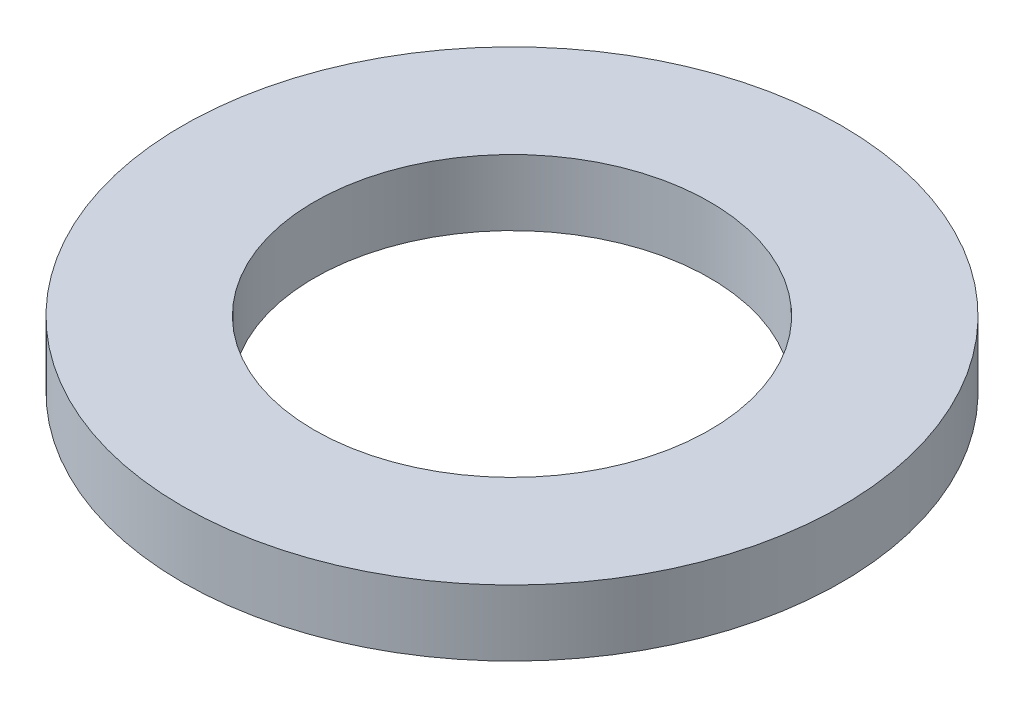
ISO-10303-21;
HEADER;
FILE_DESCRIPTION(('STEP AP214'),'2;1');
FILE_NAME('part.step','',(''),(''),'','','');
FILE_SCHEMA(('AUTOMOTIVE_DESIGN { 1 0 10303 214 1 1 1 1 }'));
ENDSEC;
DATA;
#1=APPLICATION_CONTEXT('core data for automotive mechanical design processes');
#2=APPLICATION_PROTOCOL_DEFINITION('international standard','automotive_design',2000,#1);
#3=PRODUCT_CONTEXT('',#1,'mechanical');
#4=PRODUCT('Part','Part','',(#3));
#5=PRODUCT_RELATED_PRODUCT_CATEGORY('part','',(#4));
#6=PRODUCT_DEFINITION_FORMATION('','',#4);
#7=PRODUCT_DEFINITION_CONTEXT('part definition',#1,'design');
#8=PRODUCT_DEFINITION('design','',#6,#7);
#9=PRODUCT_DEFINITION_SHAPE('','',#8);
#10=(LENGTH_UNIT() NAMED_UNIT(*) SI_UNIT(.MILLI.,.METRE.));
#11=(NAMED_UNIT(*) PLANE_ANGLE_UNIT() SI_UNIT($,.RADIAN.));
#12=(NAMED_UNIT(*) SI_UNIT($,.STERADIAN.) SOLID_ANGLE_UNIT());
#13=UNCERTAINTY_MEASURE_WITH_UNIT(LENGTH_MEASURE(1.E-05),#10,'distance_accuracy_value','');
#14=(GEOMETRIC_REPRESENTATION_CONTEXT(3) GLOBAL_UNCERTAINTY_ASSIGNED_CONTEXT((#13)) GLOBAL_UNIT_ASSIGNED_CONTEXT((#10,
#11,#12)) REPRESENTATION_CONTEXT('',''));
#15=CARTESIAN_POINT('',(0.,0.,0.));
#16=DIRECTION('',(0.,0.,1.));
#17=DIRECTION('',(1.,0.,0.));
#18=AXIS2_PLACEMENT_3D('',#15,#16,#17);
#19=CARTESIAN_POINT('',(0.,8.,0.));
#20=DIRECTION('',(0.,1.,0.));
#21=DIRECTION('',(0.,0.,1.));
#22=AXIS2_PLACEMENT_3D('',#19,#20,#21);
#23=PLANE('',#22);
#24=CARTESIAN_POINT('',(0.,8.,0.));
#25=DIRECTION('',(0.,1.,0.));
#26=DIRECTION('',(0.,0.,1.));
#27=AXIS2_PLACEMENT_3D('',#24,#25,#26);
#28=CIRCLE('',#27,40.);
#29=CARTESIAN_POINT('',(0.,8.,40.));
#30=VERTEX_POINT('',#29);
#31=EDGE_CURVE('E10',#30,#30,#28,.T.);
#32=ORIENTED_EDGE('',*,*,#31,.T.);
#33=EDGE_LOOP('',(#32));
#34=FACE_BOUND('',#33,.T.);
#35=CARTESIAN_POINT('',(0.,8.,0.));
#36=DIRECTION('',(0.,1.,0.));
#37=DIRECTION('',(0.,0.,1.));
#38=AXIS2_PLACEMENT_3D('',#35,#36,#37);
#39=CIRCLE('',#38,24.);
#40=CARTESIAN_POINT('',(0.,8.,24.));
#41=VERTEX_POINT('',#40);
#42=EDGE_CURVE('E39',#41,#41,#39,.T.);
#43=ORIENTED_EDGE('',*,*,#42,.F.);
#44=EDGE_LOOP('',(#43));
#45=FACE_BOUND('',#44,.T.);
#46=ADVANCED_FACE('F28',(#34,#45),#23,.T.);
#47=CARTESIAN_POINT('',(0.,0.,0.));
#48=DIRECTION('',(0.,1.,0.));
#49=DIRECTION('',(0.,0.,1.));
#50=AXIS2_PLACEMENT_3D('',#47,#48,#49);
#51=PLANE('',#50);
#52=CARTESIAN_POINT('',(0.,0.,0.));
#53=DIRECTION('',(0.,1.,0.));
#54=DIRECTION('',(0.,0.,1.));
#55=AXIS2_PLACEMENT_3D('',#52,#53,#54);
#56=CIRCLE('',#55,40.);
#57=CARTESIAN_POINT('',(0.,0.,40.));
#58=VERTEX_POINT('',#57);
#59=EDGE_CURVE('E35',#58,#58,#56,.T.);
#60=ORIENTED_EDGE('',*,*,#59,.F.);
#61=EDGE_LOOP('',(#60));
#62=FACE_BOUND('',#61,.T.);
#63=CARTESIAN_POINT('',(0.,0.,0.));
#64=DIRECTION('',(0.,1.,0.));
#65=DIRECTION('',(0.,0.,1.));
#66=AXIS2_PLACEMENT_3D('',#63,#64,#65);
#67=CIRCLE('',#66,24.);
#68=CARTESIAN_POINT('',(0.,0.,24.));
#69=VERTEX_POINT('',#68);
#70=EDGE_CURVE('E43',#69,#69,#67,.T.);
#71=ORIENTED_EDGE('',*,*,#70,.T.);
#72=EDGE_LOOP('',(#71));
#73=FACE_BOUND('',#72,.T.);
#74=ADVANCED_FACE('F49',(#62,#73),#51,.F.);
#75=CARTESIAN_POINT('',(0.,8.,0.));
#76=DIRECTION('',(0.,-1.,0.));
#77=DIRECTION('',(0.,0.,-1.));
#78=AXIS2_PLACEMENT_3D('',#75,#76,#77);
#79=CYLINDRICAL_SURFACE('',#78,40.);
#80=ORIENTED_EDGE('',*,*,#31,.F.);
#81=EDGE_LOOP('',(#80));
#82=FACE_BOUND('',#81,.T.);
#83=ORIENTED_EDGE('',*,*,#59,.T.);
#84=EDGE_LOOP('',(#83));
#85=FACE_BOUND('',#84,.T.);
#86=ADVANCED_FACE('F30',(#82,#85),#79,.T.);
#87=CARTESIAN_POINT('',(0.,8.,0.));
#88=DIRECTION('',(0.,-1.,0.));
#89=DIRECTION('',(0.,0.,-1.));
#90=AXIS2_PLACEMENT_3D('',#87,#88,#89);
#91=CYLINDRICAL_SURFACE('',#90,24.);
#92=ORIENTED_EDGE('',*,*,#42,.T.);
#93=EDGE_LOOP('',(#92));
#94=FACE_BOUND('',#93,.T.);
#95=ORIENTED_EDGE('',*,*,#70,.F.);
#96=EDGE_LOOP('',(#95));
#97=FACE_BOUND('',#96,.T.);
#98=ADVANCED_FACE('F51',(#94,#97),#91,.F.);
#99=CLOSED_SHELL('',(#46,#74,#86,#98));
#100=MANIFOLD_SOLID_BREP('B2',#99);
#101=ADVANCED_BREP_SHAPE_REPRESENTATION('',(#18,#100),#14);
#102=SHAPE_DEFINITION_REPRESENTATION(#9,#101);
ENDSEC;
END-ISO-10303-21;
